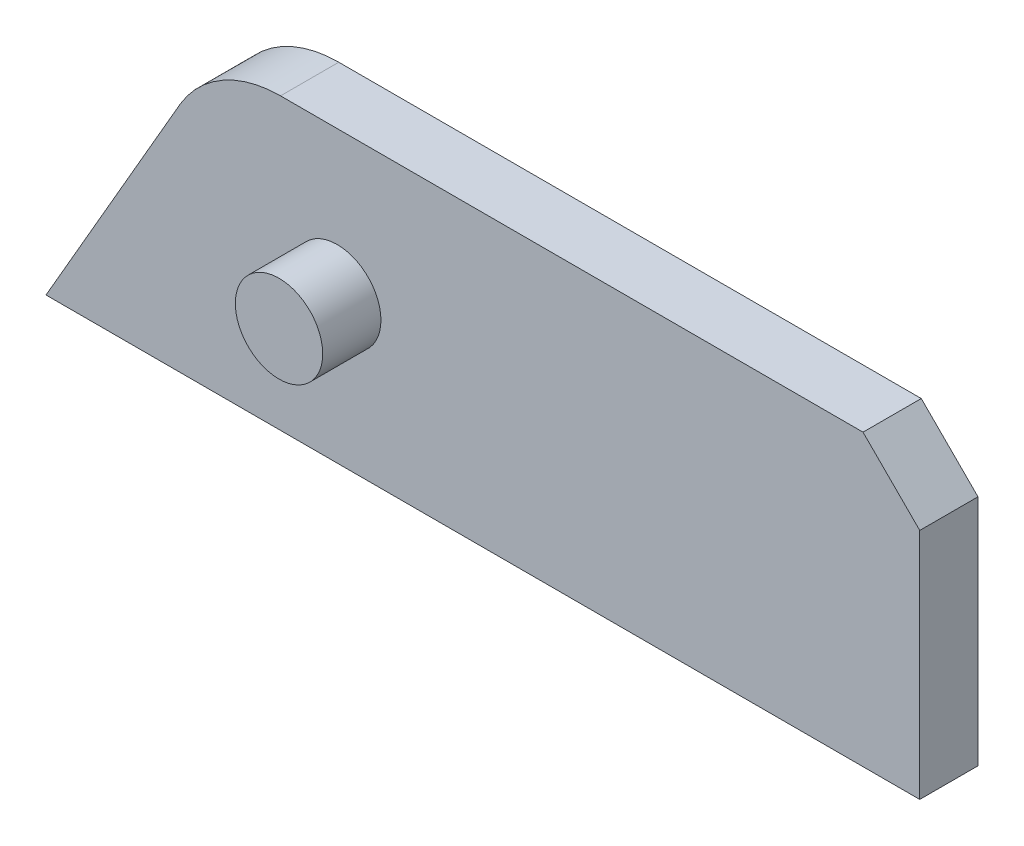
from build123d import *

# Parameters (mm, degrees)
BOSS_EXTRUDE1_DEPTH = 10
SKETCH4_R           = 7.5
BOSS_EXTRUDE2_DEPTH = 10


with BuildPart() as part:
    # Sketch3 → Boss-Extrude1 (new body)
    with BuildSketch(Plane.XY):
        with BuildLine():
            Line((0, 0), (0, 40))
            Line((0, 40), (-9.738884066, 49.738884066))
            Line((-9.738884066, 49.738884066), (-109.738884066, 49.738884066))
            ThreePointArc((-109.738884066, 49.738884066), (-119.607462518, 47.13460651), (-126.905989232, 40))
            Line((-126.905989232, 40), (-150, 0))
            Line((-150, 0), (0, 0))
        make_face()
    extrude(amount=BOSS_EXTRUDE1_DEPTH)

    # Sketch4 → Boss-Extrude2 (add)
    with BuildSketch(Plane.XY.offset(10)):
        with Locations((-100, 25)):
            Circle(SKETCH4_R)
    extrude(amount=BOSS_EXTRUDE2_DEPTH)


solid = part.part
